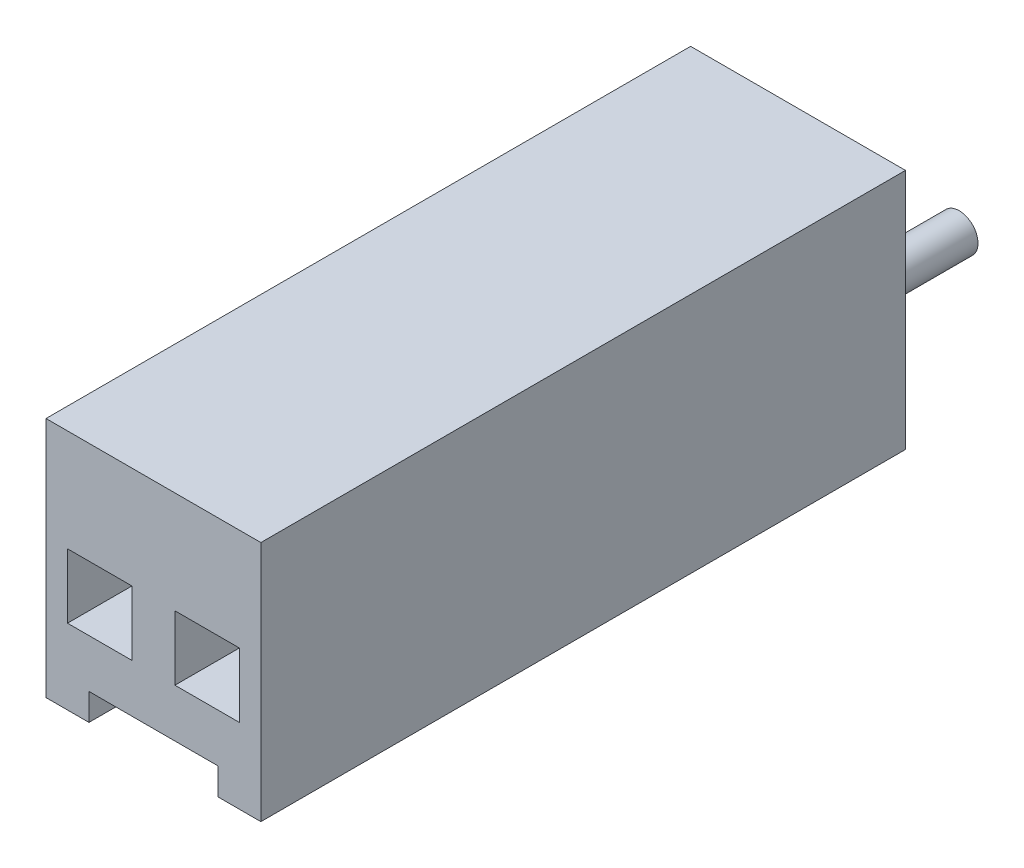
ISO-10303-21;
HEADER;
FILE_DESCRIPTION(('STEP AP214'),'2;1');
FILE_NAME('part.step','',(''),(''),'','','');
FILE_SCHEMA(('AUTOMOTIVE_DESIGN { 1 0 10303 214 1 1 1 1 }'));
ENDSEC;
DATA;
#1=APPLICATION_CONTEXT('core data for automotive mechanical design processes');
#2=APPLICATION_PROTOCOL_DEFINITION('international standard','automotive_design',2000,#1);
#3=PRODUCT_CONTEXT('',#1,'mechanical');
#4=PRODUCT('Part','Part','',(#3));
#5=PRODUCT_RELATED_PRODUCT_CATEGORY('part','',(#4));
#6=PRODUCT_DEFINITION_FORMATION('','',#4);
#7=PRODUCT_DEFINITION_CONTEXT('part definition',#1,'design');
#8=PRODUCT_DEFINITION('design','',#6,#7);
#9=PRODUCT_DEFINITION_SHAPE('','',#8);
#10=(LENGTH_UNIT() NAMED_UNIT(*) SI_UNIT(.MILLI.,.METRE.));
#11=(NAMED_UNIT(*) PLANE_ANGLE_UNIT() SI_UNIT($,.RADIAN.));
#12=(NAMED_UNIT(*) SI_UNIT($,.STERADIAN.) SOLID_ANGLE_UNIT());
#13=UNCERTAINTY_MEASURE_WITH_UNIT(LENGTH_MEASURE(1.E-05),#10,'distance_accuracy_value','');
#14=(GEOMETRIC_REPRESENTATION_CONTEXT(3) GLOBAL_UNCERTAINTY_ASSIGNED_CONTEXT((#13)) GLOBAL_UNIT_ASSIGNED_CONTEXT((#10,
#11,#12)) REPRESENTATION_CONTEXT('',''));
#15=CARTESIAN_POINT('',(0.,0.,0.));
#16=DIRECTION('',(0.,0.,1.));
#17=DIRECTION('',(1.,0.,0.));
#18=AXIS2_PLACEMENT_3D('',#15,#16,#17);
#19=CARTESIAN_POINT('',(-1.27,-1.905,15.24));
#20=DIRECTION('',(0.,1.,0.));
#21=DIRECTION('',(0.,0.,1.));
#22=AXIS2_PLACEMENT_3D('',#19,#20,#21);
#23=PLANE('',#22);
#24=DIRECTION('',(0.,0.,-1.));
#25=VECTOR('',#24,1.);
#26=CARTESIAN_POINT('',(2.794,-1.905,15.24));
#27=LINE('',#26,#25);
#28=CARTESIAN_POINT('',(2.794,-1.905,15.24));
#29=VERTEX_POINT('',#28);
#30=CARTESIAN_POINT('',(2.794,-1.905,2.54));
#31=VERTEX_POINT('',#30);
#32=EDGE_CURVE('E237',#29,#31,#27,.T.);
#33=ORIENTED_EDGE('',*,*,#32,.F.);
#34=DIRECTION('',(1.,0.,0.));
#35=VECTOR('',#34,1.);
#36=CARTESIAN_POINT('',(-1.27,-1.905,15.24));
#37=LINE('',#36,#35);
#38=CARTESIAN_POINT('',(-0.253999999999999,-1.905,15.24));
#39=VERTEX_POINT('',#38);
#40=EDGE_CURVE('E275',#39,#29,#37,.T.);
#41=ORIENTED_EDGE('',*,*,#40,.F.);
#42=DIRECTION('',(0.,0.,1.));
#43=VECTOR('',#42,1.);
#44=CARTESIAN_POINT('',(-0.254,-1.905,15.24));
#45=LINE('',#44,#43);
#46=CARTESIAN_POINT('',(-0.253999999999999,-1.905,2.54));
#47=VERTEX_POINT('',#46);
#48=EDGE_CURVE('E253',#47,#39,#45,.T.);
#49=ORIENTED_EDGE('',*,*,#48,.F.);
#50=DIRECTION('',(1.,0.,0.));
#51=VECTOR('',#50,1.);
#52=CARTESIAN_POINT('',(-1.27,-1.905,2.54));
#53=LINE('',#52,#51);
#54=CARTESIAN_POINT('',(0.,-1.905,2.54));
#55=VERTEX_POINT('',#54);
#56=EDGE_CURVE('E276',#47,#55,#53,.T.);
#57=ORIENTED_EDGE('',*,*,#56,.T.);
#58=DIRECTION('',(0.,0.,-1.));
#59=VECTOR('',#58,1.);
#60=CARTESIAN_POINT('',(0.,-1.905,10.16));
#61=LINE('',#60,#59);
#62=CARTESIAN_POINT('',(0.,-1.905,10.16));
#63=VERTEX_POINT('',#62);
#64=EDGE_CURVE('E299',#63,#55,#61,.T.);
#65=ORIENTED_EDGE('',*,*,#64,.F.);
#66=DIRECTION('',(-1.,0.,0.));
#67=VECTOR('',#66,1.);
#68=CARTESIAN_POINT('',(0.,-1.905,10.16));
#69=LINE('',#68,#67);
#70=CARTESIAN_POINT('',(2.54,-1.905,10.16));
#71=VERTEX_POINT('',#70);
#72=EDGE_CURVE('E296',#71,#63,#69,.T.);
#73=ORIENTED_EDGE('',*,*,#72,.F.);
#74=DIRECTION('',(0.,0.,-1.));
#75=VECTOR('',#74,1.);
#76=CARTESIAN_POINT('',(2.54,-1.905,10.16));
#77=LINE('',#76,#75);
#78=CARTESIAN_POINT('',(2.54,-1.905,2.54));
#79=VERTEX_POINT('',#78);
#80=EDGE_CURVE('E330',#71,#79,#77,.T.);
#81=ORIENTED_EDGE('',*,*,#80,.T.);
#82=EDGE_CURVE('E271',#79,#31,#53,.T.);
#83=ORIENTED_EDGE('',*,*,#82,.T.);
#84=EDGE_LOOP('',(#33,#41,#49,#57,#65,#73,#81,#83));
#85=FACE_BOUND('',#84,.T.);
#86=ADVANCED_FACE('F35',(#85),#23,.F.);
#87=CARTESIAN_POINT('',(-1.27,-2.54,2.54));
#88=DIRECTION('',(0.,0.,1.));
#89=DIRECTION('',(1.,0.,0.));
#90=AXIS2_PLACEMENT_3D('',#87,#88,#89);
#91=PLANE('',#90);
#92=DIRECTION('',(1.,0.,0.));
#93=VECTOR('',#92,1.);
#94=CARTESIAN_POINT('',(-1.27,-2.54,2.54));
#95=LINE('',#94,#93);
#96=CARTESIAN_POINT('',(2.54,-2.54,2.54));
#97=VERTEX_POINT('',#96);
#98=CARTESIAN_POINT('',(2.794,-2.54,2.54));
#99=VERTEX_POINT('',#98);
#100=EDGE_CURVE('E323',#97,#99,#95,.T.);
#101=ORIENTED_EDGE('',*,*,#100,.T.);
#102=DIRECTION('',(0.,1.,0.));
#103=VECTOR('',#102,1.);
#104=CARTESIAN_POINT('',(2.794,-2.54,2.54));
#105=LINE('',#104,#103);
#106=EDGE_CURVE('E250',#99,#31,#105,.T.);
#107=ORIENTED_EDGE('',*,*,#106,.T.);
#108=ORIENTED_EDGE('',*,*,#82,.F.);
#109=DIRECTION('',(0.,1.,0.));
#110=VECTOR('',#109,1.);
#111=CARTESIAN_POINT('',(2.54,-2.54,2.54));
#112=LINE('',#111,#110);
#113=EDGE_CURVE('E291',#97,#79,#112,.T.);
#114=ORIENTED_EDGE('',*,*,#113,.F.);
#115=EDGE_LOOP('',(#101,#107,#108,#114));
#116=FACE_BOUND('',#115,.T.);
#117=ADVANCED_FACE('F373',(#116),#91,.T.);
#118=ORIENTED_EDGE('',*,*,#56,.F.);
#119=DIRECTION('',(0.,1.,0.));
#120=VECTOR('',#119,1.);
#121=CARTESIAN_POINT('',(-0.253999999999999,-2.54,2.54));
#122=LINE('',#121,#120);
#123=CARTESIAN_POINT('',(-0.253999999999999,-2.54,2.54));
#124=VERTEX_POINT('',#123);
#125=EDGE_CURVE('E263',#124,#47,#122,.T.);
#126=ORIENTED_EDGE('',*,*,#125,.F.);
#127=CARTESIAN_POINT('',(0.,-2.54,2.54));
#128=VERTEX_POINT('',#127);
#129=EDGE_CURVE('E39',#124,#128,#95,.T.);
#130=ORIENTED_EDGE('',*,*,#129,.T.);
#131=DIRECTION('',(0.,-1.,0.));
#132=VECTOR('',#131,1.);
#133=CARTESIAN_POINT('',(0.,-2.54,2.54));
#134=LINE('',#133,#132);
#135=EDGE_CURVE('E285',#55,#128,#134,.T.);
#136=ORIENTED_EDGE('',*,*,#135,.F.);
#137=EDGE_LOOP('',(#118,#126,#130,#136));
#138=FACE_BOUND('',#137,.T.);
#139=ADVANCED_FACE('F402',(#138),#91,.T.);
#140=CARTESIAN_POINT('',(-1.27,-2.54,0.));
#141=DIRECTION('',(0.,0.,1.));
#142=DIRECTION('',(1.,0.,0.));
#143=AXIS2_PLACEMENT_3D('',#140,#141,#142);
#144=PLANE('',#143);
#145=CARTESIAN_POINT('',(0.,0.,0.));
#146=DIRECTION('',(0.,0.,1.));
#147=DIRECTION('',(1.,0.,0.));
#148=AXIS2_PLACEMENT_3D('',#145,#146,#147);
#149=CIRCLE('',#148,0.4445);
#150=CARTESIAN_POINT('',(0.4445,0.,0.));
#151=VERTEX_POINT('',#150);
#152=EDGE_CURVE('E45',#151,#151,#149,.F.);
#153=ORIENTED_EDGE('',*,*,#152,.F.);
#154=EDGE_LOOP('',(#153));
#155=FACE_BOUND('',#154,.T.);
#156=DIRECTION('',(0.,-1.,0.));
#157=VECTOR('',#156,1.);
#158=CARTESIAN_POINT('',(-1.27,3.17499999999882,0.));
#159=LINE('',#158,#157);
#160=CARTESIAN_POINT('',(-1.27,3.17499999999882,0.));
#161=VERTEX_POINT('',#160);
#162=CARTESIAN_POINT('',(-1.27,-2.54,0.));
#163=VERTEX_POINT('',#162);
#164=EDGE_CURVE('E331',#161,#163,#159,.T.);
#165=ORIENTED_EDGE('',*,*,#164,.F.);
#166=DIRECTION('',(-1.,0.,0.));
#167=VECTOR('',#166,1.);
#168=CARTESIAN_POINT('',(-1.27,3.17499999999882,0.));
#169=LINE('',#168,#167);
#170=CARTESIAN_POINT('',(3.81000000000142,3.17499999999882,0.));
#171=VERTEX_POINT('',#170);
#172=EDGE_CURVE('E326',#171,#161,#169,.T.);
#173=ORIENTED_EDGE('',*,*,#172,.F.);
#174=DIRECTION('',(0.,1.,0.));
#175=VECTOR('',#174,1.);
#176=CARTESIAN_POINT('',(3.81000000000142,3.17499999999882,0.));
#177=LINE('',#176,#175);
#178=CARTESIAN_POINT('',(3.81000000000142,-2.54,0.));
#179=VERTEX_POINT('',#178);
#180=EDGE_CURVE('E337',#179,#171,#177,.T.);
#181=ORIENTED_EDGE('',*,*,#180,.F.);
#182=DIRECTION('',(1.,0.,0.));
#183=VECTOR('',#182,1.);
#184=CARTESIAN_POINT('',(-1.27,-2.54,0.));
#185=LINE('',#184,#183);
#186=EDGE_CURVE('E334',#163,#179,#185,.T.);
#187=ORIENTED_EDGE('',*,*,#186,.F.);
#188=EDGE_LOOP('',(#165,#173,#181,#187));
#189=FACE_BOUND('',#188,.T.);
#190=CARTESIAN_POINT('',(2.54,0.,0.));
#191=DIRECTION('',(0.,0.,1.));
#192=DIRECTION('',(1.,0.,0.));
#193=AXIS2_PLACEMENT_3D('',#190,#191,#192);
#194=CIRCLE('',#193,0.4445);
#195=CARTESIAN_POINT('',(2.9845,0.,0.));
#196=VERTEX_POINT('',#195);
#197=EDGE_CURVE('E11',#196,#196,#194,.F.);
#198=ORIENTED_EDGE('',*,*,#197,.F.);
#199=EDGE_LOOP('',(#198));
#200=FACE_BOUND('',#199,.T.);
#201=ADVANCED_FACE('F352',(#155,#189,#200),#144,.F.);
#202=CARTESIAN_POINT('',(-1.27,3.17499999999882,2.54));
#203=DIRECTION('',(1.,0.,0.));
#204=DIRECTION('',(0.,1.,0.));
#205=AXIS2_PLACEMENT_3D('',#202,#203,#204);
#206=PLANE('',#205);
#207=DIRECTION('',(0.,0.,-1.));
#208=VECTOR('',#207,1.);
#209=CARTESIAN_POINT('',(-1.27,-2.54,2.54));
#210=LINE('',#209,#208);
#211=CARTESIAN_POINT('',(-1.27,-2.54,15.24));
#212=VERTEX_POINT('',#211);
#213=EDGE_CURVE('E310',#212,#163,#210,.T.);
#214=ORIENTED_EDGE('',*,*,#213,.F.);
#215=DIRECTION('',(0.,-1.,0.));
#216=VECTOR('',#215,1.);
#217=CARTESIAN_POINT('',(-1.27,3.17499999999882,15.24));
#218=LINE('',#217,#216);
#219=CARTESIAN_POINT('',(-1.27,3.17499999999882,15.24));
#220=VERTEX_POINT('',#219);
#221=EDGE_CURVE('E272',#220,#212,#218,.T.);
#222=ORIENTED_EDGE('',*,*,#221,.F.);
#223=DIRECTION('',(0.,0.,-1.));
#224=VECTOR('',#223,1.);
#225=CARTESIAN_POINT('',(-1.27,3.17499999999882,2.54));
#226=LINE('',#225,#224);
#227=EDGE_CURVE('E340',#220,#161,#226,.T.);
#228=ORIENTED_EDGE('',*,*,#227,.T.);
#229=ORIENTED_EDGE('',*,*,#164,.T.);
#230=EDGE_LOOP('',(#214,#222,#228,#229));
#231=FACE_BOUND('',#230,.T.);
#232=ADVANCED_FACE('F37',(#231),#206,.F.);
#233=CARTESIAN_POINT('',(-1.27,-2.54,2.54));
#234=DIRECTION('',(0.,1.,0.));
#235=DIRECTION('',(0.,0.,1.));
#236=AXIS2_PLACEMENT_3D('',#233,#234,#235);
#237=PLANE('',#236);
#238=ORIENTED_EDGE('',*,*,#186,.T.);
#239=DIRECTION('',(0.,0.,-1.));
#240=VECTOR('',#239,1.);
#241=CARTESIAN_POINT('',(3.81000000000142,-2.54,2.54));
#242=LINE('',#241,#240);
#243=CARTESIAN_POINT('',(3.81,-2.54,15.24));
#244=VERTEX_POINT('',#243);
#245=EDGE_CURVE('E314',#244,#179,#242,.T.);
#246=ORIENTED_EDGE('',*,*,#245,.F.);
#247=DIRECTION('',(-1.,0.,0.));
#248=VECTOR('',#247,1.);
#249=CARTESIAN_POINT('',(2.794,-2.54,15.24));
#250=LINE('',#249,#248);
#251=CARTESIAN_POINT('',(2.794,-2.54,15.24));
#252=VERTEX_POINT('',#251);
#253=EDGE_CURVE('E245',#244,#252,#250,.T.);
#254=ORIENTED_EDGE('',*,*,#253,.T.);
#255=DIRECTION('',(0.,0.,-1.));
#256=VECTOR('',#255,1.);
#257=CARTESIAN_POINT('',(2.794,-2.54,15.24));
#258=LINE('',#257,#256);
#259=EDGE_CURVE('E243',#252,#99,#258,.T.);
#260=ORIENTED_EDGE('',*,*,#259,.T.);
#261=ORIENTED_EDGE('',*,*,#100,.F.);
#262=DIRECTION('',(0.,0.,-1.));
#263=VECTOR('',#262,1.);
#264=CARTESIAN_POINT('',(2.54,-2.54,10.16));
#265=LINE('',#264,#263);
#266=CARTESIAN_POINT('',(2.54,-2.54,10.16));
#267=VERTEX_POINT('',#266);
#268=EDGE_CURVE('E377',#267,#97,#265,.T.);
#269=ORIENTED_EDGE('',*,*,#268,.F.);
#270=DIRECTION('',(1.,0.,0.));
#271=VECTOR('',#270,1.);
#272=CARTESIAN_POINT('',(0.,-2.54,10.16));
#273=LINE('',#272,#271);
#274=CARTESIAN_POINT('',(0.,-2.54,10.16));
#275=VERTEX_POINT('',#274);
#276=EDGE_CURVE('E290',#275,#267,#273,.T.);
#277=ORIENTED_EDGE('',*,*,#276,.F.);
#278=DIRECTION('',(0.,0.,-1.));
#279=VECTOR('',#278,1.);
#280=CARTESIAN_POINT('',(0.,-2.54,10.16));
#281=LINE('',#280,#279);
#282=EDGE_CURVE('E335',#275,#128,#281,.T.);
#283=ORIENTED_EDGE('',*,*,#282,.T.);
#284=ORIENTED_EDGE('',*,*,#129,.F.);
#285=DIRECTION('',(0.,0.,1.));
#286=VECTOR('',#285,1.);
#287=CARTESIAN_POINT('',(-0.254,-2.54,15.24));
#288=LINE('',#287,#286);
#289=CARTESIAN_POINT('',(-0.254,-2.54,15.24));
#290=VERTEX_POINT('',#289);
#291=EDGE_CURVE('E254',#124,#290,#288,.T.);
#292=ORIENTED_EDGE('',*,*,#291,.T.);
#293=DIRECTION('',(-1.,0.,0.));
#294=VECTOR('',#293,1.);
#295=CARTESIAN_POINT('',(-1.27,-2.54,15.24));
#296=LINE('',#295,#294);
#297=EDGE_CURVE('E256',#290,#212,#296,.T.);
#298=ORIENTED_EDGE('',*,*,#297,.T.);
#299=ORIENTED_EDGE('',*,*,#213,.T.);
#300=EDGE_LOOP('',(#238,#246,#254,#260,#261,#269,#277,#283,#284,#292,#298,#299));
#301=FACE_BOUND('',#300,.T.);
#302=ADVANCED_FACE('F362',(#301),#237,.F.);
#303=CARTESIAN_POINT('',(3.81000000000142,3.17499999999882,2.54));
#304=DIRECTION('',(-1.,0.,0.));
#305=DIRECTION('',(0.,0.,1.));
#306=AXIS2_PLACEMENT_3D('',#303,#304,#305);
#307=PLANE('',#306);
#308=ORIENTED_EDGE('',*,*,#180,.T.);
#309=DIRECTION('',(0.,0.,-1.));
#310=VECTOR('',#309,1.);
#311=CARTESIAN_POINT('',(3.81000000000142,3.17499999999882,2.54));
#312=LINE('',#311,#310);
#313=CARTESIAN_POINT('',(3.81000000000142,3.17499999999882,15.24));
#314=VERTEX_POINT('',#313);
#315=EDGE_CURVE('E319',#314,#171,#312,.T.);
#316=ORIENTED_EDGE('',*,*,#315,.F.);
#317=DIRECTION('',(0.,1.,0.));
#318=VECTOR('',#317,1.);
#319=CARTESIAN_POINT('',(3.81000000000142,3.17499999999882,15.24));
#320=LINE('',#319,#318);
#321=EDGE_CURVE('E279',#244,#314,#320,.T.);
#322=ORIENTED_EDGE('',*,*,#321,.F.);
#323=ORIENTED_EDGE('',*,*,#245,.T.);
#324=EDGE_LOOP('',(#308,#316,#322,#323));
#325=FACE_BOUND('',#324,.T.);
#326=ADVANCED_FACE('F361',(#325),#307,.F.);
#327=CARTESIAN_POINT('',(-1.27,3.17499999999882,2.54));
#328=DIRECTION('',(0.,-1.,0.));
#329=DIRECTION('',(0.,0.,-1.));
#330=AXIS2_PLACEMENT_3D('',#327,#328,#329);
#331=PLANE('',#330);
#332=ORIENTED_EDGE('',*,*,#172,.T.);
#333=ORIENTED_EDGE('',*,*,#227,.F.);
#334=DIRECTION('',(-1.,0.,0.));
#335=VECTOR('',#334,1.);
#336=CARTESIAN_POINT('',(-1.27,3.17499999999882,15.24));
#337=LINE('',#336,#335);
#338=EDGE_CURVE('E282',#314,#220,#337,.T.);
#339=ORIENTED_EDGE('',*,*,#338,.F.);
#340=ORIENTED_EDGE('',*,*,#315,.T.);
#341=EDGE_LOOP('',(#332,#333,#339,#340));
#342=FACE_BOUND('',#341,.T.);
#343=ADVANCED_FACE('F346',(#342),#331,.F.);
#344=CARTESIAN_POINT('',(0.,-2.54,10.16));
#345=DIRECTION('',(1.,0.,0.));
#346=DIRECTION('',(0.,0.,-1.));
#347=AXIS2_PLACEMENT_3D('',#344,#345,#346);
#348=PLANE('',#347);
#349=ORIENTED_EDGE('',*,*,#135,.T.);
#350=ORIENTED_EDGE('',*,*,#282,.F.);
#351=DIRECTION('',(0.,-1.,0.));
#352=VECTOR('',#351,1.);
#353=CARTESIAN_POINT('',(0.,-2.54,10.16));
#354=LINE('',#353,#352);
#355=EDGE_CURVE('E287',#63,#275,#354,.T.);
#356=ORIENTED_EDGE('',*,*,#355,.F.);
#357=ORIENTED_EDGE('',*,*,#64,.T.);
#358=EDGE_LOOP('',(#349,#350,#356,#357));
#359=FACE_BOUND('',#358,.T.);
#360=ADVANCED_FACE('F391',(#359),#348,.F.);
#361=CARTESIAN_POINT('',(2.54,-2.54,10.16));
#362=DIRECTION('',(-1.,0.,0.));
#363=DIRECTION('',(0.,0.,1.));
#364=AXIS2_PLACEMENT_3D('',#361,#362,#363);
#365=PLANE('',#364);
#366=ORIENTED_EDGE('',*,*,#113,.T.);
#367=ORIENTED_EDGE('',*,*,#80,.F.);
#368=DIRECTION('',(0.,1.,0.));
#369=VECTOR('',#368,1.);
#370=CARTESIAN_POINT('',(2.54,-2.54,10.16));
#371=LINE('',#370,#369);
#372=EDGE_CURVE('E293',#267,#71,#371,.T.);
#373=ORIENTED_EDGE('',*,*,#372,.F.);
#374=ORIENTED_EDGE('',*,*,#268,.T.);
#375=EDGE_LOOP('',(#366,#367,#373,#374));
#376=FACE_BOUND('',#375,.T.);
#377=ADVANCED_FACE('F380',(#376),#365,.F.);
#378=CARTESIAN_POINT('',(0.,-1.905,10.16));
#379=DIRECTION('',(0.,0.,-1.));
#380=DIRECTION('',(-1.,0.,0.));
#381=AXIS2_PLACEMENT_3D('',#378,#379,#380);
#382=PLANE('',#381);
#383=ORIENTED_EDGE('',*,*,#355,.T.);
#384=ORIENTED_EDGE('',*,*,#276,.T.);
#385=ORIENTED_EDGE('',*,*,#372,.T.);
#386=ORIENTED_EDGE('',*,*,#72,.T.);
#387=EDGE_LOOP('',(#383,#384,#385,#386));
#388=FACE_BOUND('',#387,.T.);
#389=ADVANCED_FACE('F397',(#388),#382,.F.);
#390=CARTESIAN_POINT('',(-1.27,-1.905,15.24));
#391=DIRECTION('',(0.,0.,1.));
#392=DIRECTION('',(1.,0.,0.));
#393=AXIS2_PLACEMENT_3D('',#390,#391,#392);
#394=PLANE('',#393);
#395=DIRECTION('',(0.,-1.,0.));
#396=VECTOR('',#395,1.);
#397=CARTESIAN_POINT('',(1.778,0.762,15.24));
#398=LINE('',#397,#396);
#399=CARTESIAN_POINT('',(1.778,0.762,15.24));
#400=VERTEX_POINT('',#399);
#401=CARTESIAN_POINT('',(1.778,-0.762,15.24));
#402=VERTEX_POINT('',#401);
#403=EDGE_CURVE('E52',#400,#402,#398,.T.);
#404=ORIENTED_EDGE('',*,*,#403,.F.);
#405=DIRECTION('',(-1.,0.,0.));
#406=VECTOR('',#405,1.);
#407=CARTESIAN_POINT('',(1.778,0.762,15.24));
#408=LINE('',#407,#406);
#409=CARTESIAN_POINT('',(3.302,0.762,15.24));
#410=VERTEX_POINT('',#409);
#411=EDGE_CURVE('E194',#410,#400,#408,.T.);
#412=ORIENTED_EDGE('',*,*,#411,.F.);
#413=DIRECTION('',(0.,1.,0.));
#414=VECTOR('',#413,1.);
#415=CARTESIAN_POINT('',(3.302,0.762,15.24));
#416=LINE('',#415,#414);
#417=CARTESIAN_POINT('',(3.302,-0.762,15.24));
#418=VERTEX_POINT('',#417);
#419=EDGE_CURVE('E197',#418,#410,#416,.T.);
#420=ORIENTED_EDGE('',*,*,#419,.F.);
#421=DIRECTION('',(1.,0.,0.));
#422=VECTOR('',#421,1.);
#423=CARTESIAN_POINT('',(1.778,-0.762,15.24));
#424=LINE('',#423,#422);
#425=EDGE_CURVE('E203',#402,#418,#424,.T.);
#426=ORIENTED_EDGE('',*,*,#425,.F.);
#427=EDGE_LOOP('',(#404,#412,#420,#426));
#428=FACE_BOUND('',#427,.T.);
#429=DIRECTION('',(0.,-1.,0.));
#430=VECTOR('',#429,1.);
#431=CARTESIAN_POINT('',(-0.762,0.762,15.24));
#432=LINE('',#431,#430);
#433=CARTESIAN_POINT('',(-0.762,0.762,15.24));
#434=VERTEX_POINT('',#433);
#435=CARTESIAN_POINT('',(-0.762,-0.762,15.24));
#436=VERTEX_POINT('',#435);
#437=EDGE_CURVE('E60',#434,#436,#432,.T.);
#438=ORIENTED_EDGE('',*,*,#437,.F.);
#439=DIRECTION('',(-1.,0.,0.));
#440=VECTOR('',#439,1.);
#441=CARTESIAN_POINT('',(-0.762,0.762,15.24));
#442=LINE('',#441,#440);
#443=CARTESIAN_POINT('',(0.762,0.762,15.24));
#444=VERTEX_POINT('',#443);
#445=EDGE_CURVE('E216',#444,#434,#442,.T.);
#446=ORIENTED_EDGE('',*,*,#445,.F.);
#447=DIRECTION('',(0.,1.,0.));
#448=VECTOR('',#447,1.);
#449=CARTESIAN_POINT('',(0.762,0.762,15.24));
#450=LINE('',#449,#448);
#451=CARTESIAN_POINT('',(0.762,-0.762,15.24));
#452=VERTEX_POINT('',#451);
#453=EDGE_CURVE('E230',#452,#444,#450,.T.);
#454=ORIENTED_EDGE('',*,*,#453,.F.);
#455=DIRECTION('',(1.,0.,0.));
#456=VECTOR('',#455,1.);
#457=CARTESIAN_POINT('',(-0.762,-0.762,15.24));
#458=LINE('',#457,#456);
#459=EDGE_CURVE('E227',#436,#452,#458,.T.);
#460=ORIENTED_EDGE('',*,*,#459,.F.);
#461=EDGE_LOOP('',(#438,#446,#454,#460));
#462=FACE_BOUND('',#461,.T.);
#463=ORIENTED_EDGE('',*,*,#221,.T.);
#464=ORIENTED_EDGE('',*,*,#297,.F.);
#465=DIRECTION('',(0.,1.,0.));
#466=VECTOR('',#465,1.);
#467=CARTESIAN_POINT('',(-0.254,-2.54,15.24));
#468=LINE('',#467,#466);
#469=EDGE_CURVE('E259',#290,#39,#468,.T.);
#470=ORIENTED_EDGE('',*,*,#469,.T.);
#471=ORIENTED_EDGE('',*,*,#40,.T.);
#472=DIRECTION('',(0.,1.,0.));
#473=VECTOR('',#472,1.);
#474=CARTESIAN_POINT('',(2.794,-2.54,15.24));
#475=LINE('',#474,#473);
#476=EDGE_CURVE('E247',#252,#29,#475,.T.);
#477=ORIENTED_EDGE('',*,*,#476,.F.);
#478=ORIENTED_EDGE('',*,*,#253,.F.);
#479=ORIENTED_EDGE('',*,*,#321,.T.);
#480=ORIENTED_EDGE('',*,*,#338,.T.);
#481=EDGE_LOOP('',(#463,#464,#470,#471,#477,#478,#479,#480));
#482=FACE_BOUND('',#481,.T.);
#483=ADVANCED_FACE('F357',(#428,#462,#482),#394,.T.);
#484=CARTESIAN_POINT('',(0.,0.,-2.54));
#485=DIRECTION('',(0.,0.,1.));
#486=DIRECTION('',(1.,0.,0.));
#487=AXIS2_PLACEMENT_3D('',#484,#485,#486);
#488=CYLINDRICAL_SURFACE('',#487,0.4445);
#489=CARTESIAN_POINT('',(0.,0.,-2.54));
#490=DIRECTION('',(0.,0.,-1.));
#491=DIRECTION('',(-1.,0.,0.));
#492=AXIS2_PLACEMENT_3D('',#489,#490,#491);
#493=CIRCLE('',#492,0.4445);
#494=CARTESIAN_POINT('',(-0.4445,0.,-2.54));
#495=VERTEX_POINT('',#494);
#496=EDGE_CURVE('E268',#495,#495,#493,.T.);
#497=ORIENTED_EDGE('',*,*,#496,.F.);
#498=EDGE_LOOP('',(#497));
#499=FACE_BOUND('',#498,.T.);
#500=ORIENTED_EDGE('',*,*,#152,.T.);
#501=EDGE_LOOP('',(#500));
#502=FACE_BOUND('',#501,.T.);
#503=ADVANCED_FACE('F478',(#499,#502),#488,.T.);
#504=CARTESIAN_POINT('',(0.,0.,-2.54));
#505=DIRECTION('',(0.,0.,-1.));
#506=DIRECTION('',(-1.,0.,0.));
#507=AXIS2_PLACEMENT_3D('',#504,#505,#506);
#508=PLANE('',#507);
#509=ORIENTED_EDGE('',*,*,#496,.T.);
#510=EDGE_LOOP('',(#509));
#511=FACE_BOUND('',#510,.T.);
#512=ADVANCED_FACE('F470',(#511),#508,.T.);
#513=CARTESIAN_POINT('',(2.54,0.,-2.54));
#514=DIRECTION('',(0.,0.,1.));
#515=DIRECTION('',(1.,0.,0.));
#516=AXIS2_PLACEMENT_3D('',#513,#514,#515);
#517=CYLINDRICAL_SURFACE('',#516,0.4445);
#518=CARTESIAN_POINT('',(2.54,0.,-2.54));
#519=DIRECTION('',(0.,0.,-1.));
#520=DIRECTION('',(-1.,0.,0.));
#521=AXIS2_PLACEMENT_3D('',#518,#519,#520);
#522=CIRCLE('',#521,0.4445);
#523=CARTESIAN_POINT('',(2.0955,0.,-2.54));
#524=VERTEX_POINT('',#523);
#525=EDGE_CURVE('E265',#524,#524,#522,.T.);
#526=ORIENTED_EDGE('',*,*,#525,.F.);
#527=EDGE_LOOP('',(#526));
#528=FACE_BOUND('',#527,.T.);
#529=ORIENTED_EDGE('',*,*,#197,.T.);
#530=EDGE_LOOP('',(#529));
#531=FACE_BOUND('',#530,.T.);
#532=ADVANCED_FACE('F415',(#528,#531),#517,.T.);
#533=CARTESIAN_POINT('',(2.54,0.,-2.54));
#534=DIRECTION('',(0.,0.,-1.));
#535=DIRECTION('',(-1.,0.,0.));
#536=AXIS2_PLACEMENT_3D('',#533,#534,#535);
#537=PLANE('',#536);
#538=ORIENTED_EDGE('',*,*,#525,.T.);
#539=EDGE_LOOP('',(#538));
#540=FACE_BOUND('',#539,.T.);
#541=ADVANCED_FACE('F406',(#540),#537,.T.);
#542=CARTESIAN_POINT('',(-0.254,-2.54,15.24));
#543=DIRECTION('',(-1.,0.,0.));
#544=DIRECTION('',(0.,0.,1.));
#545=AXIS2_PLACEMENT_3D('',#542,#543,#544);
#546=PLANE('',#545);
#547=ORIENTED_EDGE('',*,*,#48,.T.);
#548=ORIENTED_EDGE('',*,*,#469,.F.);
#549=ORIENTED_EDGE('',*,*,#291,.F.);
#550=ORIENTED_EDGE('',*,*,#125,.T.);
#551=EDGE_LOOP('',(#547,#548,#549,#550));
#552=FACE_BOUND('',#551,.T.);
#553=ADVANCED_FACE('F404',(#552),#546,.F.);
#554=CARTESIAN_POINT('',(2.794,-2.54,15.24));
#555=DIRECTION('',(1.,0.,0.));
#556=DIRECTION('',(0.,0.,-1.));
#557=AXIS2_PLACEMENT_3D('',#554,#555,#556);
#558=PLANE('',#557);
#559=ORIENTED_EDGE('',*,*,#32,.T.);
#560=ORIENTED_EDGE('',*,*,#106,.F.);
#561=ORIENTED_EDGE('',*,*,#259,.F.);
#562=ORIENTED_EDGE('',*,*,#476,.T.);
#563=EDGE_LOOP('',(#559,#560,#561,#562));
#564=FACE_BOUND('',#563,.T.);
#565=ADVANCED_FACE('F369',(#564),#558,.F.);
#566=CARTESIAN_POINT('',(-0.762,0.762,2.54));
#567=DIRECTION('',(-1.,0.,0.));
#568=DIRECTION('',(0.,0.,1.));
#569=AXIS2_PLACEMENT_3D('',#566,#567,#568);
#570=PLANE('',#569);
#571=ORIENTED_EDGE('',*,*,#437,.T.);
#572=DIRECTION('',(0.,0.,1.));
#573=VECTOR('',#572,1.);
#574=CARTESIAN_POINT('',(-0.762,-0.762,2.54));
#575=LINE('',#574,#573);
#576=CARTESIAN_POINT('',(-0.762,-0.762,2.54));
#577=VERTEX_POINT('',#576);
#578=EDGE_CURVE('E225',#577,#436,#575,.T.);
#579=ORIENTED_EDGE('',*,*,#578,.F.);
#580=DIRECTION('',(0.,-1.,0.));
#581=VECTOR('',#580,1.);
#582=CARTESIAN_POINT('',(-0.762,0.762,2.54));
#583=LINE('',#582,#581);
#584=CARTESIAN_POINT('',(-0.762,0.762,2.54));
#585=VERTEX_POINT('',#584);
#586=EDGE_CURVE('E212',#585,#577,#583,.T.);
#587=ORIENTED_EDGE('',*,*,#586,.F.);
#588=DIRECTION('',(0.,0.,1.));
#589=VECTOR('',#588,1.);
#590=CARTESIAN_POINT('',(-0.762,0.762,2.54));
#591=LINE('',#590,#589);
#592=EDGE_CURVE('E235',#585,#434,#591,.T.);
#593=ORIENTED_EDGE('',*,*,#592,.T.);
#594=EDGE_LOOP('',(#571,#579,#587,#593));
#595=FACE_BOUND('',#594,.T.);
#596=ADVANCED_FACE('F412',(#595),#570,.F.);
#597=CARTESIAN_POINT('',(-0.762,0.762,2.54));
#598=DIRECTION('',(0.,1.,0.));
#599=DIRECTION('',(0.,0.,1.));
#600=AXIS2_PLACEMENT_3D('',#597,#598,#599);
#601=PLANE('',#600);
#602=ORIENTED_EDGE('',*,*,#445,.T.);
#603=ORIENTED_EDGE('',*,*,#592,.F.);
#604=DIRECTION('',(-1.,0.,0.));
#605=VECTOR('',#604,1.);
#606=CARTESIAN_POINT('',(-0.762,0.762,2.54));
#607=LINE('',#606,#605);
#608=CARTESIAN_POINT('',(0.762,0.762,2.54));
#609=VERTEX_POINT('',#608);
#610=EDGE_CURVE('E222',#609,#585,#607,.T.);
#611=ORIENTED_EDGE('',*,*,#610,.F.);
#612=DIRECTION('',(0.,0.,1.));
#613=VECTOR('',#612,1.);
#614=CARTESIAN_POINT('',(0.762,0.762,2.54));
#615=LINE('',#614,#613);
#616=EDGE_CURVE('E238',#609,#444,#615,.T.);
#617=ORIENTED_EDGE('',*,*,#616,.T.);
#618=EDGE_LOOP('',(#602,#603,#611,#617));
#619=FACE_BOUND('',#618,.T.);
#620=ADVANCED_FACE('F588',(#619),#601,.F.);
#621=CARTESIAN_POINT('',(0.762,0.762,2.54));
#622=DIRECTION('',(1.,0.,0.));
#623=DIRECTION('',(0.,1.,0.));
#624=AXIS2_PLACEMENT_3D('',#621,#622,#623);
#625=PLANE('',#624);
#626=ORIENTED_EDGE('',*,*,#453,.T.);
#627=ORIENTED_EDGE('',*,*,#616,.F.);
#628=DIRECTION('',(0.,1.,0.));
#629=VECTOR('',#628,1.);
#630=CARTESIAN_POINT('',(0.762,0.762,2.54));
#631=LINE('',#630,#629);
#632=CARTESIAN_POINT('',(0.762,-0.762,2.54));
#633=VERTEX_POINT('',#632);
#634=EDGE_CURVE('E219',#633,#609,#631,.T.);
#635=ORIENTED_EDGE('',*,*,#634,.F.);
#636=DIRECTION('',(0.,0.,1.));
#637=VECTOR('',#636,1.);
#638=CARTESIAN_POINT('',(0.762,-0.762,2.54));
#639=LINE('',#638,#637);
#640=EDGE_CURVE('E240',#633,#452,#639,.T.);
#641=ORIENTED_EDGE('',*,*,#640,.T.);
#642=EDGE_LOOP('',(#626,#627,#635,#641));
#643=FACE_BOUND('',#642,.T.);
#644=ADVANCED_FACE('F597',(#643),#625,.F.);
#645=CARTESIAN_POINT('',(-0.762,-0.762,2.54));
#646=DIRECTION('',(0.,-1.,0.));
#647=DIRECTION('',(0.,0.,-1.));
#648=AXIS2_PLACEMENT_3D('',#645,#646,#647);
#649=PLANE('',#648);
#650=ORIENTED_EDGE('',*,*,#459,.T.);
#651=ORIENTED_EDGE('',*,*,#640,.F.);
#652=DIRECTION('',(1.,0.,0.));
#653=VECTOR('',#652,1.);
#654=CARTESIAN_POINT('',(-0.762,-0.762,2.54));
#655=LINE('',#654,#653);
#656=EDGE_CURVE('E215',#577,#633,#655,.T.);
#657=ORIENTED_EDGE('',*,*,#656,.F.);
#658=ORIENTED_EDGE('',*,*,#578,.T.);
#659=EDGE_LOOP('',(#650,#651,#657,#658));
#660=FACE_BOUND('',#659,.T.);
#661=ADVANCED_FACE('F607',(#660),#649,.F.);
#662=CARTESIAN_POINT('',(-0.762,-0.762,2.54));
#663=DIRECTION('',(0.,0.,1.));
#664=DIRECTION('',(1.,0.,0.));
#665=AXIS2_PLACEMENT_3D('',#662,#663,#664);
#666=PLANE('',#665);
#667=ORIENTED_EDGE('',*,*,#586,.T.);
#668=ORIENTED_EDGE('',*,*,#656,.T.);
#669=ORIENTED_EDGE('',*,*,#634,.T.);
#670=ORIENTED_EDGE('',*,*,#610,.T.);
#671=EDGE_LOOP('',(#667,#668,#669,#670));
#672=FACE_BOUND('',#671,.T.);
#673=ADVANCED_FACE('F617',(#672),#666,.T.);
#674=CARTESIAN_POINT('',(1.778,0.762,2.54));
#675=DIRECTION('',(-1.,0.,0.));
#676=DIRECTION('',(0.,0.,1.));
#677=AXIS2_PLACEMENT_3D('',#674,#675,#676);
#678=PLANE('',#677);
#679=ORIENTED_EDGE('',*,*,#403,.T.);
#680=DIRECTION('',(0.,0.,1.));
#681=VECTOR('',#680,1.);
#682=CARTESIAN_POINT('',(1.778,-0.762,2.54));
#683=LINE('',#682,#681);
#684=CARTESIAN_POINT('',(1.778,-0.762,2.54));
#685=VERTEX_POINT('',#684);
#686=EDGE_CURVE('E172',#685,#402,#683,.T.);
#687=ORIENTED_EDGE('',*,*,#686,.F.);
#688=DIRECTION('',(0.,-1.,0.));
#689=VECTOR('',#688,1.);
#690=CARTESIAN_POINT('',(1.778,0.762,2.54));
#691=LINE('',#690,#689);
#692=CARTESIAN_POINT('',(1.778,0.762,2.54));
#693=VERTEX_POINT('',#692);
#694=EDGE_CURVE('E176',#693,#685,#691,.T.);
#695=ORIENTED_EDGE('',*,*,#694,.F.);
#696=DIRECTION('',(0.,0.,1.));
#697=VECTOR('',#696,1.);
#698=CARTESIAN_POINT('',(1.778,0.762,2.54));
#699=LINE('',#698,#697);
#700=EDGE_CURVE('E207',#693,#400,#699,.T.);
#701=ORIENTED_EDGE('',*,*,#700,.T.);
#702=EDGE_LOOP('',(#679,#687,#695,#701));
#703=FACE_BOUND('',#702,.T.);
#704=ADVANCED_FACE('F174',(#703),#678,.F.);
#705=CARTESIAN_POINT('',(1.778,0.762,2.54));
#706=DIRECTION('',(0.,1.,0.));
#707=DIRECTION('',(0.,0.,1.));
#708=AXIS2_PLACEMENT_3D('',#705,#706,#707);
#709=PLANE('',#708);
#710=ORIENTED_EDGE('',*,*,#411,.T.);
#711=ORIENTED_EDGE('',*,*,#700,.F.);
#712=DIRECTION('',(-1.,0.,0.));
#713=VECTOR('',#712,1.);
#714=CARTESIAN_POINT('',(1.778,0.762,2.54));
#715=LINE('',#714,#713);
#716=CARTESIAN_POINT('',(3.302,0.762,2.54));
#717=VERTEX_POINT('',#716);
#718=EDGE_CURVE('E182',#717,#693,#715,.T.);
#719=ORIENTED_EDGE('',*,*,#718,.F.);
#720=DIRECTION('',(0.,0.,1.));
#721=VECTOR('',#720,1.);
#722=CARTESIAN_POINT('',(3.302,0.762,2.54));
#723=LINE('',#722,#721);
#724=EDGE_CURVE('E209',#717,#410,#723,.T.);
#725=ORIENTED_EDGE('',*,*,#724,.T.);
#726=EDGE_LOOP('',(#710,#711,#719,#725));
#727=FACE_BOUND('',#726,.T.);
#728=ADVANCED_FACE('F636',(#727),#709,.F.);
#729=CARTESIAN_POINT('',(3.302,0.762,2.54));
#730=DIRECTION('',(1.,0.,0.));
#731=DIRECTION('',(0.,0.,-1.));
#732=AXIS2_PLACEMENT_3D('',#729,#730,#731);
#733=PLANE('',#732);
#734=ORIENTED_EDGE('',*,*,#419,.T.);
#735=ORIENTED_EDGE('',*,*,#724,.F.);
#736=DIRECTION('',(0.,1.,0.));
#737=VECTOR('',#736,1.);
#738=CARTESIAN_POINT('',(3.302,0.762,2.54));
#739=LINE('',#738,#737);
#740=CARTESIAN_POINT('',(3.302,-0.762,2.54));
#741=VERTEX_POINT('',#740);
#742=EDGE_CURVE('E190',#741,#717,#739,.T.);
#743=ORIENTED_EDGE('',*,*,#742,.F.);
#744=DIRECTION('',(0.,0.,1.));
#745=VECTOR('',#744,1.);
#746=CARTESIAN_POINT('',(3.302,-0.762,2.54));
#747=LINE('',#746,#745);
#748=EDGE_CURVE('E181',#741,#418,#747,.T.);
#749=ORIENTED_EDGE('',*,*,#748,.T.);
#750=EDGE_LOOP('',(#734,#735,#743,#749));
#751=FACE_BOUND('',#750,.T.);
#752=ADVANCED_FACE('F645',(#751),#733,.F.);
#753=CARTESIAN_POINT('',(1.778,-0.762,2.54));
#754=DIRECTION('',(0.,-1.,0.));
#755=DIRECTION('',(0.,0.,-1.));
#756=AXIS2_PLACEMENT_3D('',#753,#754,#755);
#757=PLANE('',#756);
#758=ORIENTED_EDGE('',*,*,#425,.T.);
#759=ORIENTED_EDGE('',*,*,#748,.F.);
#760=DIRECTION('',(1.,0.,0.));
#761=VECTOR('',#760,1.);
#762=CARTESIAN_POINT('',(1.778,-0.762,2.54));
#763=LINE('',#762,#761);
#764=EDGE_CURVE('E185',#685,#741,#763,.T.);
#765=ORIENTED_EDGE('',*,*,#764,.F.);
#766=ORIENTED_EDGE('',*,*,#686,.T.);
#767=EDGE_LOOP('',(#758,#759,#765,#766));
#768=FACE_BOUND('',#767,.T.);
#769=ADVANCED_FACE('F186',(#768),#757,.F.);
#770=CARTESIAN_POINT('',(1.778,-0.762,2.54));
#771=DIRECTION('',(0.,0.,1.));
#772=DIRECTION('',(1.,0.,0.));
#773=AXIS2_PLACEMENT_3D('',#770,#771,#772);
#774=PLANE('',#773);
#775=ORIENTED_EDGE('',*,*,#694,.T.);
#776=ORIENTED_EDGE('',*,*,#764,.T.);
#777=ORIENTED_EDGE('',*,*,#742,.T.);
#778=ORIENTED_EDGE('',*,*,#718,.T.);
#779=EDGE_LOOP('',(#775,#776,#777,#778));
#780=FACE_BOUND('',#779,.T.);
#781=ADVANCED_FACE('F192',(#780),#774,.T.);
#782=CLOSED_SHELL('',(#86,#117,#139,#201,#232,#302,#326,#343,#360,#377,#389,#483,#503,#512,#532,
#541,#553,#565,#596,#620,#644,#661,#673,#704,#728,#752,#769,#781));
#783=MANIFOLD_SOLID_BREP('B2',#782);
#784=ADVANCED_BREP_SHAPE_REPRESENTATION('',(#18,#783),#14);
#785=SHAPE_DEFINITION_REPRESENTATION(#9,#784);
ENDSEC;
END-ISO-10303-21;
